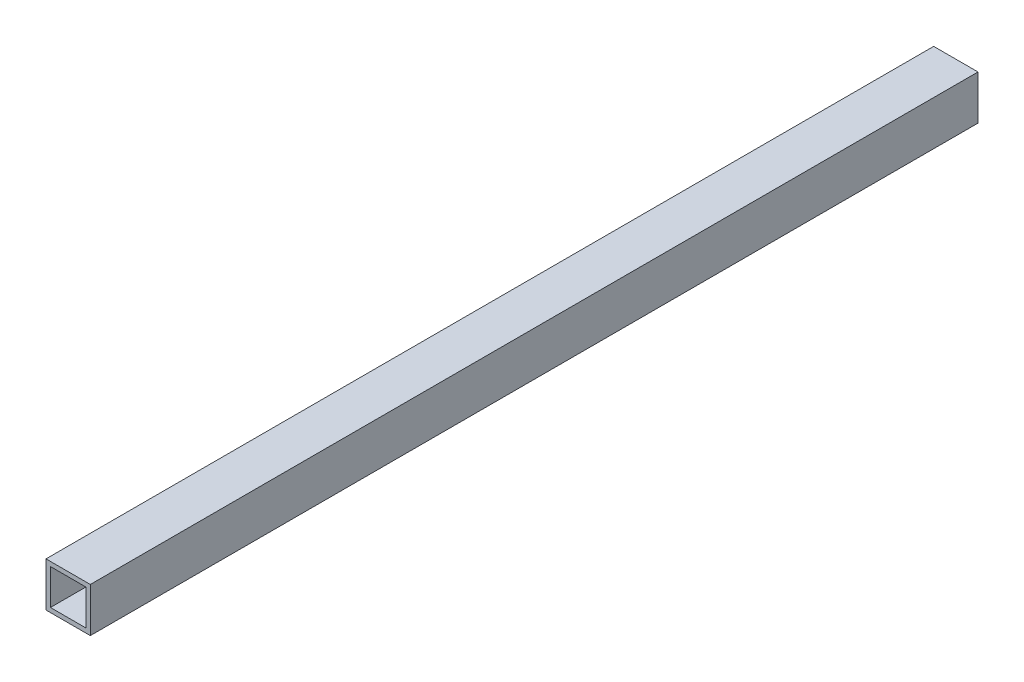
from build123d import *

# Parameters (mm, degrees)
ESQUISSE1_W        = 10
ESQUISSE1_H        = 10
ESQUISSE1_W_2      = 8
ESQUISSE1_H_2      = 8
BOSS_EXTRU_2_DEPTH = 200.25


with BuildPart() as part:
    # Esquisse1 → Boss.-Extru.2 (new body)
    with BuildSketch(Plane.XY):
        with Locations((0.080613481, 1.217148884)):
            Rectangle(ESQUISSE1_W, ESQUISSE1_H)
        with Locations((0.080613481, 1.217148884)):
            Rectangle(ESQUISSE1_W_2, ESQUISSE1_H_2, mode=Mode.SUBTRACT)
    extrude(amount=BOSS_EXTRU_2_DEPTH)


solid = part.part
